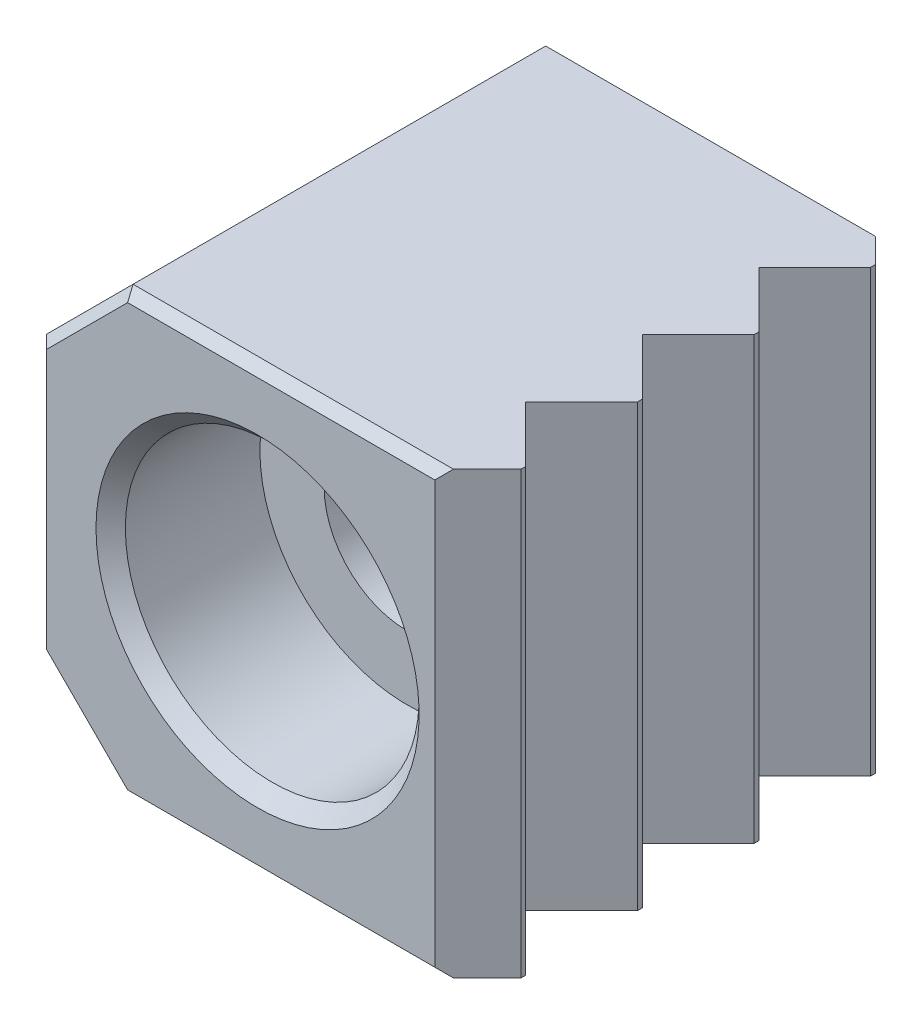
ISO-10303-21;
HEADER;
FILE_DESCRIPTION(('STEP AP214'),'2;1');
FILE_NAME('part.step','',(''),(''),'','','');
FILE_SCHEMA(('AUTOMOTIVE_DESIGN { 1 0 10303 214 1 1 1 1 }'));
ENDSEC;
DATA;
#1=APPLICATION_CONTEXT('core data for automotive mechanical design processes');
#2=APPLICATION_PROTOCOL_DEFINITION('international standard','automotive_design',2000,#1);
#3=PRODUCT_CONTEXT('',#1,'mechanical');
#4=PRODUCT('Part','Part','',(#3));
#5=PRODUCT_RELATED_PRODUCT_CATEGORY('part','',(#4));
#6=PRODUCT_DEFINITION_FORMATION('','',#4);
#7=PRODUCT_DEFINITION_CONTEXT('part definition',#1,'design');
#8=PRODUCT_DEFINITION('design','',#6,#7);
#9=PRODUCT_DEFINITION_SHAPE('','',#8);
#10=(LENGTH_UNIT() NAMED_UNIT(*) SI_UNIT(.MILLI.,.METRE.));
#11=(NAMED_UNIT(*) PLANE_ANGLE_UNIT() SI_UNIT($,.RADIAN.));
#12=(NAMED_UNIT(*) SI_UNIT($,.STERADIAN.) SOLID_ANGLE_UNIT());
#13=UNCERTAINTY_MEASURE_WITH_UNIT(LENGTH_MEASURE(1.E-05),#10,'distance_accuracy_value','');
#14=(GEOMETRIC_REPRESENTATION_CONTEXT(3) GLOBAL_UNCERTAINTY_ASSIGNED_CONTEXT((#13)) GLOBAL_UNIT_ASSIGNED_CONTEXT((#10,
#11,#12)) REPRESENTATION_CONTEXT('',''));
#15=CARTESIAN_POINT('',(0.,0.,0.));
#16=DIRECTION('',(0.,0.,1.));
#17=DIRECTION('',(1.,0.,0.));
#18=AXIS2_PLACEMENT_3D('',#15,#16,#17);
#19=CARTESIAN_POINT('',(6.,-6.,12.));
#20=DIRECTION('',(-1.,0.,0.));
#21=DIRECTION('',(0.,0.,-1.));
#22=AXIS2_PLACEMENT_3D('',#19,#20,#21);
#23=PLANE('',#22);
#24=DIRECTION('',(0.,0.,-1.));
#25=VECTOR('',#24,1.);
#26=CARTESIAN_POINT('',(6.,-6.,12.));
#27=LINE('',#26,#25);
#28=CARTESIAN_POINT('',(6.,-6.,7.652500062));
#29=VERTEX_POINT('',#28);
#30=CARTESIAN_POINT('',(6.,-6.,7.522500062));
#31=VERTEX_POINT('',#30);
#32=EDGE_CURVE('E387',#29,#31,#27,.T.);
#33=ORIENTED_EDGE('',*,*,#32,.T.);
#34=DIRECTION('',(0.,1.,0.));
#35=VECTOR('',#34,1.);
#36=CARTESIAN_POINT('',(6.,-6.,7.522500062));
#37=LINE('',#36,#35);
#38=CARTESIAN_POINT('',(6.,6.,7.522500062));
#39=VERTEX_POINT('',#38);
#40=EDGE_CURVE('E250',#31,#39,#37,.T.);
#41=ORIENTED_EDGE('',*,*,#40,.T.);
#42=DIRECTION('',(0.,0.,-1.));
#43=VECTOR('',#42,1.);
#44=CARTESIAN_POINT('',(6.,6.,12.));
#45=LINE('',#44,#43);
#46=CARTESIAN_POINT('',(6.,6.,7.652500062));
#47=VERTEX_POINT('',#46);
#48=EDGE_CURVE('E406',#47,#39,#45,.T.);
#49=ORIENTED_EDGE('',*,*,#48,.F.);
#50=DIRECTION('',(0.,1.,0.));
#51=VECTOR('',#50,1.);
#52=CARTESIAN_POINT('',(6.,-6.,7.652500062));
#53=LINE('',#52,#51);
#54=EDGE_CURVE('E248',#29,#47,#53,.T.);
#55=ORIENTED_EDGE('',*,*,#54,.F.);
#56=EDGE_LOOP('',(#33,#41,#49,#55));
#57=FACE_BOUND('',#56,.T.);
#58=ADVANCED_FACE('F15',(#57),#23,.F.);
#59=DIRECTION('',(0.,-1.,0.));
#60=VECTOR('',#59,1.);
#61=CARTESIAN_POINT('',(6.,-6.,10.697500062));
#62=LINE('',#61,#60);
#63=CARTESIAN_POINT('',(6.,6.,10.697500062));
#64=VERTEX_POINT('',#63);
#65=CARTESIAN_POINT('',(6.,-6.,10.697500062));
#66=VERTEX_POINT('',#65);
#67=EDGE_CURVE('E246',#64,#66,#62,.T.);
#68=ORIENTED_EDGE('',*,*,#67,.F.);
#69=CARTESIAN_POINT('',(6.,6.,10.827500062));
#70=VERTEX_POINT('',#69);
#71=EDGE_CURVE('E266',#70,#64,#45,.T.);
#72=ORIENTED_EDGE('',*,*,#71,.F.);
#73=DIRECTION('',(0.,1.,0.));
#74=VECTOR('',#73,1.);
#75=CARTESIAN_POINT('',(6.,-6.,10.827500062));
#76=LINE('',#75,#74);
#77=CARTESIAN_POINT('',(6.,-6.,10.827500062));
#78=VERTEX_POINT('',#77);
#79=EDGE_CURVE('E238',#78,#70,#76,.T.);
#80=ORIENTED_EDGE('',*,*,#79,.F.);
#81=EDGE_CURVE('E261',#78,#66,#27,.T.);
#82=ORIENTED_EDGE('',*,*,#81,.T.);
#83=EDGE_LOOP('',(#68,#72,#80,#82));
#84=FACE_BOUND('',#83,.T.);
#85=ADVANCED_FACE('F353',(#84),#23,.F.);
#86=CARTESIAN_POINT('',(6.,-6.,1.302500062));
#87=VERTEX_POINT('',#86);
#88=CARTESIAN_POINT('',(6.,-6.,1.172500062));
#89=VERTEX_POINT('',#88);
#90=EDGE_CURVE('E199',#87,#89,#27,.T.);
#91=ORIENTED_EDGE('',*,*,#90,.T.);
#92=DIRECTION('',(0.,1.,0.));
#93=VECTOR('',#92,1.);
#94=CARTESIAN_POINT('',(6.,-6.,1.172500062));
#95=LINE('',#94,#93);
#96=CARTESIAN_POINT('',(6.,6.,1.172500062));
#97=VERTEX_POINT('',#96);
#98=EDGE_CURVE('E233',#89,#97,#95,.T.);
#99=ORIENTED_EDGE('',*,*,#98,.T.);
#100=CARTESIAN_POINT('',(6.,6.,1.302500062));
#101=VERTEX_POINT('',#100);
#102=EDGE_CURVE('E262',#101,#97,#45,.T.);
#103=ORIENTED_EDGE('',*,*,#102,.F.);
#104=DIRECTION('',(0.,-1.,0.));
#105=VECTOR('',#104,1.);
#106=CARTESIAN_POINT('',(6.,-6.,1.30250006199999));
#107=LINE('',#106,#105);
#108=EDGE_CURVE('E244',#101,#87,#107,.T.);
#109=ORIENTED_EDGE('',*,*,#108,.T.);
#110=EDGE_LOOP('',(#91,#99,#103,#109));
#111=FACE_BOUND('',#110,.T.);
#112=ADVANCED_FACE('F360',(#111),#23,.F.);
#113=CARTESIAN_POINT('',(-6.,6.,12.));
#114=DIRECTION('',(0.,1.,0.));
#115=DIRECTION('',(-1.,0.,0.));
#116=AXIS2_PLACEMENT_3D('',#113,#114,#115);
#117=PLANE('',#116);
#118=DIRECTION('',(0.,0.,1.));
#119=VECTOR('',#118,1.);
#120=CARTESIAN_POINT('',(-3.64415,6.,12.));
#121=LINE('',#120,#119);
#122=CARTESIAN_POINT('',(-3.64415,6.,0.508));
#123=VERTEX_POINT('',#122);
#124=CARTESIAN_POINT('',(-3.64415,6.,11.746));
#125=VERTEX_POINT('',#124);
#126=EDGE_CURVE('E279',#123,#125,#121,.T.);
#127=ORIENTED_EDGE('',*,*,#126,.T.);
#128=DIRECTION('',(1.,0.,0.));
#129=VECTOR('',#128,1.);
#130=CARTESIAN_POINT('',(4.827500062,6.,11.746));
#131=LINE('',#130,#129);
#132=CARTESIAN_POINT('',(5.081500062,6.,11.746));
#133=VERTEX_POINT('',#132);
#134=EDGE_CURVE('E329',#125,#133,#131,.T.);
#135=ORIENTED_EDGE('',*,*,#134,.T.);
#136=DIRECTION('',(-0.707106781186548,0.,0.707106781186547));
#137=VECTOR('',#136,1.);
#138=CARTESIAN_POINT('',(6.065,6.,10.762500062));
#139=LINE('',#138,#137);
#140=EDGE_CURVE('E226',#70,#133,#139,.T.);
#141=ORIENTED_EDGE('',*,*,#140,.F.);
#142=ORIENTED_EDGE('',*,*,#71,.T.);
#143=DIRECTION('',(0.707106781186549,0.,0.707106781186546));
#144=VECTOR('',#143,1.);
#145=CARTESIAN_POINT('',(4.4775,6.,9.17500006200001));
#146=LINE('',#145,#144);
#147=CARTESIAN_POINT('',(4.4775,6.,9.17500006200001));
#148=VERTEX_POINT('',#147);
#149=EDGE_CURVE('E229',#148,#64,#146,.T.);
#150=ORIENTED_EDGE('',*,*,#149,.F.);
#151=DIRECTION('',(-0.707106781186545,0.,0.70710678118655));
#152=VECTOR('',#151,1.);
#153=CARTESIAN_POINT('',(6.065,6.,7.587500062));
#154=LINE('',#153,#152);
#155=EDGE_CURVE('E231',#47,#148,#154,.T.);
#156=ORIENTED_EDGE('',*,*,#155,.F.);
#157=ORIENTED_EDGE('',*,*,#48,.T.);
#158=DIRECTION('',(-0.707106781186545,0.,-0.70710678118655));
#159=VECTOR('',#158,1.);
#160=CARTESIAN_POINT('',(6.065,6.,7.587500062));
#161=LINE('',#160,#159);
#162=CARTESIAN_POINT('',(4.4775,6.,6.00000006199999));
#163=VERTEX_POINT('',#162);
#164=EDGE_CURVE('E214',#39,#163,#161,.T.);
#165=ORIENTED_EDGE('',*,*,#164,.T.);
#166=DIRECTION('',(0.70710678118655,0.,-0.707106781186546));
#167=VECTOR('',#166,1.);
#168=CARTESIAN_POINT('',(4.4775,6.,6.00000006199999));
#169=LINE('',#168,#167);
#170=CARTESIAN_POINT('',(6.,6.,4.477500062));
#171=VERTEX_POINT('',#170);
#172=EDGE_CURVE('E217',#163,#171,#169,.T.);
#173=ORIENTED_EDGE('',*,*,#172,.T.);
#174=CARTESIAN_POINT('',(6.,6.,4.347500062));
#175=VERTEX_POINT('',#174);
#176=EDGE_CURVE('E265',#171,#175,#45,.T.);
#177=ORIENTED_EDGE('',*,*,#176,.T.);
#178=DIRECTION('',(-0.707106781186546,0.,-0.70710678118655));
#179=VECTOR('',#178,1.);
#180=CARTESIAN_POINT('',(6.065,6.,4.412500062));
#181=LINE('',#180,#179);
#182=CARTESIAN_POINT('',(4.4775,6.,2.82500006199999));
#183=VERTEX_POINT('',#182);
#184=EDGE_CURVE('E220',#175,#183,#181,.T.);
#185=ORIENTED_EDGE('',*,*,#184,.T.);
#186=DIRECTION('',(0.70710678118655,0.,-0.707106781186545));
#187=VECTOR('',#186,1.);
#188=CARTESIAN_POINT('',(4.4775,6.,2.82500006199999));
#189=LINE('',#188,#187);
#190=EDGE_CURVE('E189',#183,#101,#189,.T.);
#191=ORIENTED_EDGE('',*,*,#190,.T.);
#192=ORIENTED_EDGE('',*,*,#102,.T.);
#193=DIRECTION('',(-0.707106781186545,0.,-0.70710678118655));
#194=VECTOR('',#193,1.);
#195=CARTESIAN_POINT('',(6.065,6.,1.237500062));
#196=LINE('',#195,#194);
#197=CARTESIAN_POINT('',(5.33549993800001,6.,0.508));
#198=VERTEX_POINT('',#197);
#199=EDGE_CURVE('E223',#97,#198,#196,.T.);
#200=ORIENTED_EDGE('',*,*,#199,.T.);
#201=DIRECTION('',(-1.,0.,0.));
#202=VECTOR('',#201,1.);
#203=CARTESIAN_POINT('',(-6.,6.,0.508));
#204=LINE('',#203,#202);
#205=EDGE_CURVE('E306',#198,#123,#204,.T.);
#206=ORIENTED_EDGE('',*,*,#205,.T.);
#207=EDGE_LOOP('',(#127,#135,#141,#142,#150,#156,#157,#165,#173,#177,#185,#191,#192,#200,#206));
#208=FACE_BOUND('',#207,.T.);
#209=ADVANCED_FACE('F377',(#208),#117,.T.);
#210=CARTESIAN_POINT('',(6.,-6.,12.));
#211=DIRECTION('',(0.,-1.,0.));
#212=DIRECTION('',(1.,0.,0.));
#213=AXIS2_PLACEMENT_3D('',#210,#211,#212);
#214=PLANE('',#213);
#215=DIRECTION('',(-0.707106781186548,0.,0.707106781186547));
#216=VECTOR('',#215,1.);
#217=CARTESIAN_POINT('',(6.065,-6.,10.762500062));
#218=LINE('',#217,#216);
#219=CARTESIAN_POINT('',(5.08150006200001,-6.,11.746));
#220=VERTEX_POINT('',#219);
#221=EDGE_CURVE('E203',#78,#220,#218,.T.);
#222=ORIENTED_EDGE('',*,*,#221,.T.);
#223=DIRECTION('',(-1.,0.,0.));
#224=VECTOR('',#223,1.);
#225=CARTESIAN_POINT('',(-3.64415,-6.,11.746));
#226=LINE('',#225,#224);
#227=CARTESIAN_POINT('',(-3.64415,-6.,11.746));
#228=VERTEX_POINT('',#227);
#229=EDGE_CURVE('E308',#220,#228,#226,.T.);
#230=ORIENTED_EDGE('',*,*,#229,.T.);
#231=DIRECTION('',(0.,0.,-1.));
#232=VECTOR('',#231,1.);
#233=CARTESIAN_POINT('',(-3.64415,-6.,0.));
#234=LINE('',#233,#232);
#235=CARTESIAN_POINT('',(-3.64415,-6.,0.508));
#236=VERTEX_POINT('',#235);
#237=EDGE_CURVE('E273',#228,#236,#234,.T.);
#238=ORIENTED_EDGE('',*,*,#237,.T.);
#239=DIRECTION('',(1.,0.,0.));
#240=VECTOR('',#239,1.);
#241=CARTESIAN_POINT('',(6.,-6.,0.508));
#242=LINE('',#241,#240);
#243=CARTESIAN_POINT('',(5.33549993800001,-6.,0.508));
#244=VERTEX_POINT('',#243);
#245=EDGE_CURVE('E292',#236,#244,#242,.T.);
#246=ORIENTED_EDGE('',*,*,#245,.T.);
#247=DIRECTION('',(-0.707106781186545,0.,-0.70710678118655));
#248=VECTOR('',#247,1.);
#249=CARTESIAN_POINT('',(6.065,-6.,1.237500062));
#250=LINE('',#249,#248);
#251=EDGE_CURVE('E200',#89,#244,#250,.T.);
#252=ORIENTED_EDGE('',*,*,#251,.F.);
#253=ORIENTED_EDGE('',*,*,#90,.F.);
#254=DIRECTION('',(0.70710678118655,0.,-0.707106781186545));
#255=VECTOR('',#254,1.);
#256=CARTESIAN_POINT('',(4.4775,-6.,2.82500006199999));
#257=LINE('',#256,#255);
#258=CARTESIAN_POINT('',(4.4775,-6.,2.82500006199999));
#259=VERTEX_POINT('',#258);
#260=EDGE_CURVE('E182',#259,#87,#257,.T.);
#261=ORIENTED_EDGE('',*,*,#260,.F.);
#262=DIRECTION('',(-0.707106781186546,0.,-0.70710678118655));
#263=VECTOR('',#262,1.);
#264=CARTESIAN_POINT('',(6.065,-6.,4.412500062));
#265=LINE('',#264,#263);
#266=CARTESIAN_POINT('',(6.,-6.,4.347500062));
#267=VERTEX_POINT('',#266);
#268=EDGE_CURVE('E171',#267,#259,#265,.T.);
#269=ORIENTED_EDGE('',*,*,#268,.F.);
#270=CARTESIAN_POINT('',(6.,-6.,4.477500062));
#271=VERTEX_POINT('',#270);
#272=EDGE_CURVE('E260',#271,#267,#27,.T.);
#273=ORIENTED_EDGE('',*,*,#272,.F.);
#274=DIRECTION('',(0.70710678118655,0.,-0.707106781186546));
#275=VECTOR('',#274,1.);
#276=CARTESIAN_POINT('',(4.4775,-6.,6.00000006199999));
#277=LINE('',#276,#275);
#278=CARTESIAN_POINT('',(4.4775,-6.,6.00000006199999));
#279=VERTEX_POINT('',#278);
#280=EDGE_CURVE('E183',#279,#271,#277,.T.);
#281=ORIENTED_EDGE('',*,*,#280,.F.);
#282=DIRECTION('',(-0.707106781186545,0.,-0.70710678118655));
#283=VECTOR('',#282,1.);
#284=CARTESIAN_POINT('',(6.065,-6.,7.587500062));
#285=LINE('',#284,#283);
#286=EDGE_CURVE('E411',#31,#279,#285,.T.);
#287=ORIENTED_EDGE('',*,*,#286,.F.);
#288=ORIENTED_EDGE('',*,*,#32,.F.);
#289=DIRECTION('',(-0.707106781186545,0.,0.70710678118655));
#290=VECTOR('',#289,1.);
#291=CARTESIAN_POINT('',(6.065,-6.,7.587500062));
#292=LINE('',#291,#290);
#293=CARTESIAN_POINT('',(4.4775,-6.,9.17500006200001));
#294=VERTEX_POINT('',#293);
#295=EDGE_CURVE('E211',#29,#294,#292,.T.);
#296=ORIENTED_EDGE('',*,*,#295,.T.);
#297=DIRECTION('',(0.707106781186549,0.,0.707106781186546));
#298=VECTOR('',#297,1.);
#299=CARTESIAN_POINT('',(4.4775,-6.,9.17500006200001));
#300=LINE('',#299,#298);
#301=EDGE_CURVE('E208',#294,#66,#300,.T.);
#302=ORIENTED_EDGE('',*,*,#301,.T.);
#303=ORIENTED_EDGE('',*,*,#81,.F.);
#304=EDGE_LOOP('',(#222,#230,#238,#246,#252,#253,#261,#269,#273,#281,#287,#288,#296,#302,#303));
#305=FACE_BOUND('',#304,.T.);
#306=ADVANCED_FACE('F196',(#305),#214,.T.);
#307=CARTESIAN_POINT('',(6.,6.,12.));
#308=DIRECTION('',(0.,0.,-1.));
#309=DIRECTION('',(1.,0.,0.));
#310=AXIS2_PLACEMENT_3D('',#307,#308,#309);
#311=PLANE('',#310);
#312=CARTESIAN_POINT('',(0.,0.,12.));
#313=DIRECTION('',(0.,0.,-1.));
#314=DIRECTION('',(-1.,0.,0.));
#315=AXIS2_PLACEMENT_3D('',#312,#313,#314);
#316=CIRCLE('',#315,4.4);
#317=CARTESIAN_POINT('',(-4.4,0.,12.));
#318=VERTEX_POINT('',#317);
#319=EDGE_CURVE('E9',#318,#318,#316,.T.);
#320=ORIENTED_EDGE('',*,*,#319,.T.);
#321=EDGE_LOOP('',(#320));
#322=FACE_BOUND('',#321,.T.);
#323=DIRECTION('',(0.707106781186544,-0.707106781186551,0.));
#324=VECTOR('',#323,1.);
#325=CARTESIAN_POINT('',(-3.4645448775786,-5.82039487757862,12.));
#326=LINE('',#325,#324);
#327=CARTESIAN_POINT('',(-5.746,-3.5389397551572,12.));
#328=VERTEX_POINT('',#327);
#329=CARTESIAN_POINT('',(-3.53893975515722,-5.746,12.));
#330=VERTEX_POINT('',#329);
#331=EDGE_CURVE('E317',#328,#330,#326,.T.);
#332=ORIENTED_EDGE('',*,*,#331,.T.);
#333=DIRECTION('',(1.,0.,0.));
#334=VECTOR('',#333,1.);
#335=CARTESIAN_POINT('',(4.827500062,-5.746,12.));
#336=LINE('',#335,#334);
#337=CARTESIAN_POINT('',(4.827500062,-5.746,12.));
#338=VERTEX_POINT('',#337);
#339=EDGE_CURVE('E319',#330,#338,#336,.T.);
#340=ORIENTED_EDGE('',*,*,#339,.T.);
#341=DIRECTION('',(0.,-1.,0.));
#342=VECTOR('',#341,1.);
#343=CARTESIAN_POINT('',(4.827500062,6.,12.));
#344=LINE('',#343,#342);
#345=CARTESIAN_POINT('',(4.827500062,5.746,12.));
#346=VERTEX_POINT('',#345);
#347=EDGE_CURVE('E270',#346,#338,#344,.T.);
#348=ORIENTED_EDGE('',*,*,#347,.F.);
#349=DIRECTION('',(-1.,0.,0.));
#350=VECTOR('',#349,1.);
#351=CARTESIAN_POINT('',(-3.64415,5.746,12.));
#352=LINE('',#351,#350);
#353=CARTESIAN_POINT('',(-3.53893975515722,5.746,12.));
#354=VERTEX_POINT('',#353);
#355=EDGE_CURVE('E311',#346,#354,#352,.T.);
#356=ORIENTED_EDGE('',*,*,#355,.T.);
#357=DIRECTION('',(-0.707106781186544,-0.707106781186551,0.));
#358=VECTOR('',#357,1.);
#359=CARTESIAN_POINT('',(-5.82039487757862,3.46454487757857,12.));
#360=LINE('',#359,#358);
#361=CARTESIAN_POINT('',(-5.746,3.5389397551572,12.));
#362=VERTEX_POINT('',#361);
#363=EDGE_CURVE('E313',#354,#362,#360,.T.);
#364=ORIENTED_EDGE('',*,*,#363,.T.);
#365=DIRECTION('',(0.,-1.,0.));
#366=VECTOR('',#365,1.);
#367=CARTESIAN_POINT('',(-5.746,6.,12.));
#368=LINE('',#367,#366);
#369=EDGE_CURVE('E315',#362,#328,#368,.T.);
#370=ORIENTED_EDGE('',*,*,#369,.T.);
#371=EDGE_LOOP('',(#332,#340,#348,#356,#364,#370));
#372=FACE_BOUND('',#371,.T.);
#373=ADVANCED_FACE('F366',(#322,#372),#311,.F.);
#374=ORIENTED_EDGE('',*,*,#272,.T.);
#375=DIRECTION('',(0.,1.,0.));
#376=VECTOR('',#375,1.);
#377=CARTESIAN_POINT('',(6.,-6.,4.347500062));
#378=LINE('',#377,#376);
#379=EDGE_CURVE('E177',#267,#175,#378,.T.);
#380=ORIENTED_EDGE('',*,*,#379,.T.);
#381=ORIENTED_EDGE('',*,*,#176,.F.);
#382=DIRECTION('',(0.,-1.,0.));
#383=VECTOR('',#382,1.);
#384=CARTESIAN_POINT('',(6.,-6.,4.477500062));
#385=LINE('',#384,#383);
#386=EDGE_CURVE('E240',#171,#271,#385,.T.);
#387=ORIENTED_EDGE('',*,*,#386,.T.);
#388=EDGE_LOOP('',(#374,#380,#381,#387));
#389=FACE_BOUND('',#388,.T.);
#390=ADVANCED_FACE('F356',(#389),#23,.F.);
#391=CARTESIAN_POINT('',(-6.,6.,12.));
#392=DIRECTION('',(1.,0.,0.));
#393=DIRECTION('',(0.,0.,1.));
#394=AXIS2_PLACEMENT_3D('',#391,#392,#393);
#395=PLANE('',#394);
#396=DIRECTION('',(0.,0.,1.));
#397=VECTOR('',#396,1.);
#398=CARTESIAN_POINT('',(-6.,-3.64415,12.));
#399=LINE('',#398,#397);
#400=CARTESIAN_POINT('',(-6.,-3.64415,0.508));
#401=VERTEX_POINT('',#400);
#402=CARTESIAN_POINT('',(-6.,-3.64415,11.746));
#403=VERTEX_POINT('',#402);
#404=EDGE_CURVE('E277',#401,#403,#399,.T.);
#405=ORIENTED_EDGE('',*,*,#404,.T.);
#406=DIRECTION('',(0.,1.,0.));
#407=VECTOR('',#406,1.);
#408=CARTESIAN_POINT('',(-6.,6.,11.746));
#409=LINE('',#408,#407);
#410=CARTESIAN_POINT('',(-6.,3.64415,11.746));
#411=VERTEX_POINT('',#410);
#412=EDGE_CURVE('E38',#403,#411,#409,.T.);
#413=ORIENTED_EDGE('',*,*,#412,.T.);
#414=DIRECTION('',(0.,0.,-1.));
#415=VECTOR('',#414,1.);
#416=CARTESIAN_POINT('',(-6.,3.64415,0.));
#417=LINE('',#416,#415);
#418=CARTESIAN_POINT('',(-6.,3.64415,0.508));
#419=VERTEX_POINT('',#418);
#420=EDGE_CURVE('E275',#411,#419,#417,.T.);
#421=ORIENTED_EDGE('',*,*,#420,.T.);
#422=DIRECTION('',(0.,-1.,0.));
#423=VECTOR('',#422,1.);
#424=CARTESIAN_POINT('',(-6.,-3.64415,0.508));
#425=LINE('',#424,#423);
#426=EDGE_CURVE('E301',#419,#401,#425,.T.);
#427=ORIENTED_EDGE('',*,*,#426,.T.);
#428=EDGE_LOOP('',(#405,#413,#421,#427));
#429=FACE_BOUND('',#428,.T.);
#430=ADVANCED_FACE('F365',(#429),#395,.F.);
#431=CARTESIAN_POINT('',(6.,6.,0.));
#432=DIRECTION('',(0.,0.,-1.));
#433=DIRECTION('',(1.,0.,0.));
#434=AXIS2_PLACEMENT_3D('',#431,#432,#433);
#435=PLANE('',#434);
#436=CARTESIAN_POINT('',(0.,0.,0.));
#437=DIRECTION('',(0.,0.,-1.));
#438=DIRECTION('',(-1.,0.,0.));
#439=AXIS2_PLACEMENT_3D('',#436,#437,#438);
#440=CIRCLE('',#439,2.65);
#441=CARTESIAN_POINT('',(-2.65,0.,0.));
#442=VERTEX_POINT('',#441);
#443=EDGE_CURVE('E331',#442,#442,#440,.F.);
#444=ORIENTED_EDGE('',*,*,#443,.T.);
#445=EDGE_LOOP('',(#444));
#446=FACE_BOUND('',#445,.T.);
#447=DIRECTION('',(0.,1.,0.));
#448=VECTOR('',#447,1.);
#449=CARTESIAN_POINT('',(4.82749993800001,6.,0.));
#450=LINE('',#449,#448);
#451=CARTESIAN_POINT('',(4.82749993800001,-5.492,0.));
#452=VERTEX_POINT('',#451);
#453=CARTESIAN_POINT('',(4.82749993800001,5.492,0.));
#454=VERTEX_POINT('',#453);
#455=EDGE_CURVE('E267',#452,#454,#450,.T.);
#456=ORIENTED_EDGE('',*,*,#455,.F.);
#457=DIRECTION('',(-1.,0.,0.));
#458=VECTOR('',#457,1.);
#459=CARTESIAN_POINT('',(6.,-5.492,0.));
#460=LINE('',#459,#458);
#461=CARTESIAN_POINT('',(-3.43372951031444,-5.492,0.));
#462=VERTEX_POINT('',#461);
#463=EDGE_CURVE('E289',#452,#462,#460,.T.);
#464=ORIENTED_EDGE('',*,*,#463,.T.);
#465=DIRECTION('',(-0.707106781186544,0.707106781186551,0.));
#466=VECTOR('',#465,1.);
#467=CARTESIAN_POINT('',(-4.46286475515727,-4.46286475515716,0.));
#468=LINE('',#467,#466);
#469=CARTESIAN_POINT('',(-5.492,-3.43372951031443,0.));
#470=VERTEX_POINT('',#469);
#471=EDGE_CURVE('E287',#462,#470,#468,.T.);
#472=ORIENTED_EDGE('',*,*,#471,.T.);
#473=DIRECTION('',(0.,1.,0.));
#474=VECTOR('',#473,1.);
#475=CARTESIAN_POINT('',(-5.492,3.64415,0.));
#476=LINE('',#475,#474);
#477=CARTESIAN_POINT('',(-5.492,3.43372951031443,0.));
#478=VERTEX_POINT('',#477);
#479=EDGE_CURVE('E285',#470,#478,#476,.T.);
#480=ORIENTED_EDGE('',*,*,#479,.T.);
#481=DIRECTION('',(0.707106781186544,0.707106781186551,0.));
#482=VECTOR('',#481,1.);
#483=CARTESIAN_POINT('',(1.53713524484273,10.4628647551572,0.));
#484=LINE('',#483,#482);
#485=CARTESIAN_POINT('',(-3.43372951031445,5.492,0.));
#486=VERTEX_POINT('',#485);
#487=EDGE_CURVE('E283',#478,#486,#484,.T.);
#488=ORIENTED_EDGE('',*,*,#487,.T.);
#489=DIRECTION('',(1.,0.,0.));
#490=VECTOR('',#489,1.);
#491=CARTESIAN_POINT('',(6.,5.492,0.));
#492=LINE('',#491,#490);
#493=EDGE_CURVE('E281',#486,#454,#492,.T.);
#494=ORIENTED_EDGE('',*,*,#493,.T.);
#495=EDGE_LOOP('',(#456,#464,#472,#480,#488,#494));
#496=FACE_BOUND('',#495,.T.);
#497=ADVANCED_FACE('F372',(#446,#496),#435,.T.);
#498=CARTESIAN_POINT('',(0.,0.,7.936));
#499=DIRECTION('',(0.,0.,1.));
#500=DIRECTION('',(-1.,0.,0.));
#501=AXIS2_PLACEMENT_3D('',#498,#499,#500);
#502=CYLINDRICAL_SURFACE('',#501,4.);
#503=CARTESIAN_POINT('',(0.,0.,11.6));
#504=DIRECTION('',(0.,0.,-1.));
#505=DIRECTION('',(-1.,0.,0.));
#506=AXIS2_PLACEMENT_3D('',#503,#504,#505);
#507=CIRCLE('',#506,4.);
#508=CARTESIAN_POINT('',(-4.,0.,11.6));
#509=VERTEX_POINT('',#508);
#510=EDGE_CURVE('E23',#509,#509,#507,.F.);
#511=ORIENTED_EDGE('',*,*,#510,.T.);
#512=EDGE_LOOP('',(#511));
#513=FACE_BOUND('',#512,.T.);
#514=CARTESIAN_POINT('',(0.,0.,7.936));
#515=DIRECTION('',(0.,0.,1.));
#516=DIRECTION('',(-1.,0.,0.));
#517=AXIS2_PLACEMENT_3D('',#514,#515,#516);
#518=CIRCLE('',#517,4.);
#519=CARTESIAN_POINT('',(-4.,0.,7.936));
#520=VERTEX_POINT('',#519);
#521=EDGE_CURVE('E256',#520,#520,#518,.T.);
#522=ORIENTED_EDGE('',*,*,#521,.F.);
#523=EDGE_LOOP('',(#522));
#524=FACE_BOUND('',#523,.T.);
#525=ADVANCED_FACE('F339',(#513,#524),#502,.F.);
#526=CARTESIAN_POINT('',(0.,0.,7.936));
#527=DIRECTION('',(0.,0.,1.));
#528=DIRECTION('',(-1.,0.,0.));
#529=AXIS2_PLACEMENT_3D('',#526,#527,#528);
#530=PLANE('',#529);
#531=CARTESIAN_POINT('',(0.,0.,7.936));
#532=DIRECTION('',(0.,0.,1.));
#533=DIRECTION('',(-1.,0.,0.));
#534=AXIS2_PLACEMENT_3D('',#531,#532,#533);
#535=CIRCLE('',#534,2.25);
#536=CARTESIAN_POINT('',(-2.25,0.,7.936));
#537=VERTEX_POINT('',#536);
#538=EDGE_CURVE('E253',#537,#537,#535,.T.);
#539=ORIENTED_EDGE('',*,*,#538,.F.);
#540=EDGE_LOOP('',(#539));
#541=FACE_BOUND('',#540,.T.);
#542=ORIENTED_EDGE('',*,*,#521,.T.);
#543=EDGE_LOOP('',(#542));
#544=FACE_BOUND('',#543,.T.);
#545=ADVANCED_FACE('F519',(#541,#544),#530,.T.);
#546=CARTESIAN_POINT('',(0.,0.,0.));
#547=DIRECTION('',(0.,0.,1.));
#548=DIRECTION('',(-1.,0.,0.));
#549=AXIS2_PLACEMENT_3D('',#546,#547,#548);
#550=CYLINDRICAL_SURFACE('',#549,2.25);
#551=CARTESIAN_POINT('',(0.,0.,0.4));
#552=DIRECTION('',(0.,0.,-1.));
#553=DIRECTION('',(-1.,0.,0.));
#554=AXIS2_PLACEMENT_3D('',#551,#552,#553);
#555=CIRCLE('',#554,2.25);
#556=CARTESIAN_POINT('',(-2.25,0.,0.4));
#557=VERTEX_POINT('',#556);
#558=EDGE_CURVE('E334',#557,#557,#555,.T.);
#559=ORIENTED_EDGE('',*,*,#558,.T.);
#560=EDGE_LOOP('',(#559));
#561=FACE_BOUND('',#560,.T.);
#562=ORIENTED_EDGE('',*,*,#538,.T.);
#563=EDGE_LOOP('',(#562));
#564=FACE_BOUND('',#563,.T.);
#565=ADVANCED_FACE('F505',(#561,#564),#550,.F.);
#566=CARTESIAN_POINT('',(6.065,6.,1.237500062));
#567=DIRECTION('',(-0.70710678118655,0.,0.707106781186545));
#568=DIRECTION('',(-0.707106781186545,0.,-0.70710678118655));
#569=AXIS2_PLACEMENT_3D('',#566,#567,#568);
#570=PLANE('',#569);
#571=ORIENTED_EDGE('',*,*,#251,.T.);
#572=DIRECTION('',(0.577350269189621,-0.577350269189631,0.577350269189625));
#573=VECTOR('',#572,1.);
#574=CARTESIAN_POINT('',(5.218333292,-5.88283335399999,0.390833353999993));
#575=LINE('',#574,#573);
#576=EDGE_CURVE('E296',#244,#452,#575,.F.);
#577=ORIENTED_EDGE('',*,*,#576,.T.);
#578=ORIENTED_EDGE('',*,*,#455,.T.);
#579=DIRECTION('',(-0.577350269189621,-0.577350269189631,-0.577350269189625));
#580=VECTOR('',#579,1.);
#581=CARTESIAN_POINT('',(5.218333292,5.88283335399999,0.390833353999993));
#582=LINE('',#581,#580);
#583=EDGE_CURVE('E294',#454,#198,#582,.F.);
#584=ORIENTED_EDGE('',*,*,#583,.T.);
#585=ORIENTED_EDGE('',*,*,#199,.F.);
#586=ORIENTED_EDGE('',*,*,#98,.F.);
#587=EDGE_LOOP('',(#571,#577,#578,#584,#585,#586));
#588=FACE_BOUND('',#587,.T.);
#589=ADVANCED_FACE('F465',(#588),#570,.F.);
#590=CARTESIAN_POINT('',(6.065,6.,10.762500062));
#591=DIRECTION('',(0.707106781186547,0.,0.707106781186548));
#592=DIRECTION('',(-0.707106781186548,0.,0.707106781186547));
#593=AXIS2_PLACEMENT_3D('',#590,#591,#592);
#594=PLANE('',#593);
#595=ORIENTED_EDGE('',*,*,#347,.T.);
#596=DIRECTION('',(0.577350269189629,-0.57735026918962,-0.577350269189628));
#597=VECTOR('',#596,1.);
#598=CARTESIAN_POINT('',(1.73716668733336,-2.6556666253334,15.0903333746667));
#599=LINE('',#598,#597);
#600=EDGE_CURVE('E323',#338,#220,#599,.T.);
#601=ORIENTED_EDGE('',*,*,#600,.T.);
#602=ORIENTED_EDGE('',*,*,#221,.F.);
#603=ORIENTED_EDGE('',*,*,#79,.T.);
#604=ORIENTED_EDGE('',*,*,#140,.T.);
#605=DIRECTION('',(-0.577350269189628,-0.577350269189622,0.577350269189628));
#606=VECTOR('',#605,1.);
#607=CARTESIAN_POINT('',(5.73716668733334,6.65566662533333,11.0903333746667));
#608=LINE('',#607,#606);
#609=EDGE_CURVE('E321',#133,#346,#608,.T.);
#610=ORIENTED_EDGE('',*,*,#609,.T.);
#611=EDGE_LOOP('',(#595,#601,#602,#603,#604,#610));
#612=FACE_BOUND('',#611,.T.);
#613=ADVANCED_FACE('F493',(#612),#594,.T.);
#614=CARTESIAN_POINT('',(4.4775,6.,6.00000006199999));
#615=DIRECTION('',(-0.707106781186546,0.,-0.707106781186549));
#616=DIRECTION('',(0.70710678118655,0.,-0.707106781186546));
#617=AXIS2_PLACEMENT_3D('',#614,#615,#616);
#618=PLANE('',#617);
#619=ORIENTED_EDGE('',*,*,#172,.F.);
#620=DIRECTION('',(0.,-1.,0.));
#621=VECTOR('',#620,1.);
#622=CARTESIAN_POINT('',(4.4775,6.,6.00000006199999));
#623=LINE('',#622,#621);
#624=EDGE_CURVE('E192',#163,#279,#623,.T.);
#625=ORIENTED_EDGE('',*,*,#624,.T.);
#626=ORIENTED_EDGE('',*,*,#280,.T.);
#627=ORIENTED_EDGE('',*,*,#386,.F.);
#628=EDGE_LOOP('',(#619,#625,#626,#627));
#629=FACE_BOUND('',#628,.T.);
#630=ADVANCED_FACE('F497',(#629),#618,.F.);
#631=CARTESIAN_POINT('',(6.065,6.,7.587500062));
#632=DIRECTION('',(-0.70710678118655,0.,0.707106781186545));
#633=DIRECTION('',(-0.707106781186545,0.,-0.70710678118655));
#634=AXIS2_PLACEMENT_3D('',#631,#632,#633);
#635=PLANE('',#634);
#636=ORIENTED_EDGE('',*,*,#286,.T.);
#637=ORIENTED_EDGE('',*,*,#624,.F.);
#638=ORIENTED_EDGE('',*,*,#164,.F.);
#639=ORIENTED_EDGE('',*,*,#40,.F.);
#640=EDGE_LOOP('',(#636,#637,#638,#639));
#641=FACE_BOUND('',#640,.T.);
#642=ADVANCED_FACE('F410',(#641),#635,.F.);
#643=CARTESIAN_POINT('',(6.065,6.,4.412500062));
#644=DIRECTION('',(-0.70710678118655,0.,0.707106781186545));
#645=DIRECTION('',(-0.707106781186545,0.,-0.70710678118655));
#646=AXIS2_PLACEMENT_3D('',#643,#644,#645);
#647=PLANE('',#646);
#648=ORIENTED_EDGE('',*,*,#268,.T.);
#649=DIRECTION('',(0.,-1.,0.));
#650=VECTOR('',#649,1.);
#651=CARTESIAN_POINT('',(4.4775,6.,2.82500006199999));
#652=LINE('',#651,#650);
#653=EDGE_CURVE('E174',#183,#259,#652,.T.);
#654=ORIENTED_EDGE('',*,*,#653,.F.);
#655=ORIENTED_EDGE('',*,*,#184,.F.);
#656=ORIENTED_EDGE('',*,*,#379,.F.);
#657=EDGE_LOOP('',(#648,#654,#655,#656));
#658=FACE_BOUND('',#657,.T.);
#659=ADVANCED_FACE('F173',(#658),#647,.F.);
#660=CARTESIAN_POINT('',(4.4775,6.,2.82500006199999));
#661=DIRECTION('',(-0.707106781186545,0.,-0.70710678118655));
#662=DIRECTION('',(0.70710678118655,0.,-0.707106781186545));
#663=AXIS2_PLACEMENT_3D('',#660,#661,#662);
#664=PLANE('',#663);
#665=ORIENTED_EDGE('',*,*,#190,.F.);
#666=ORIENTED_EDGE('',*,*,#653,.T.);
#667=ORIENTED_EDGE('',*,*,#260,.T.);
#668=ORIENTED_EDGE('',*,*,#108,.F.);
#669=EDGE_LOOP('',(#665,#666,#667,#668));
#670=FACE_BOUND('',#669,.T.);
#671=ADVANCED_FACE('F186',(#670),#664,.F.);
#672=CARTESIAN_POINT('',(6.065,6.,7.587500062));
#673=DIRECTION('',(0.70710678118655,0.,0.707106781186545));
#674=DIRECTION('',(-0.707106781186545,0.,0.70710678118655));
#675=AXIS2_PLACEMENT_3D('',#672,#673,#674);
#676=PLANE('',#675);
#677=ORIENTED_EDGE('',*,*,#54,.T.);
#678=ORIENTED_EDGE('',*,*,#155,.T.);
#679=DIRECTION('',(0.,-1.,0.));
#680=VECTOR('',#679,1.);
#681=CARTESIAN_POINT('',(4.4775,6.,9.17500006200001));
#682=LINE('',#681,#680);
#683=EDGE_CURVE('E191',#148,#294,#682,.T.);
#684=ORIENTED_EDGE('',*,*,#683,.T.);
#685=ORIENTED_EDGE('',*,*,#295,.F.);
#686=EDGE_LOOP('',(#677,#678,#684,#685));
#687=FACE_BOUND('',#686,.T.);
#688=ADVANCED_FACE('F512',(#687),#676,.T.);
#689=CARTESIAN_POINT('',(4.4775,6.,9.17500006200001));
#690=DIRECTION('',(0.707106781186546,0.,-0.707106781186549));
#691=DIRECTION('',(0.707106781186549,0.,0.707106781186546));
#692=AXIS2_PLACEMENT_3D('',#689,#690,#691);
#693=PLANE('',#692);
#694=ORIENTED_EDGE('',*,*,#67,.T.);
#695=ORIENTED_EDGE('',*,*,#301,.F.);
#696=ORIENTED_EDGE('',*,*,#683,.F.);
#697=ORIENTED_EDGE('',*,*,#149,.T.);
#698=EDGE_LOOP('',(#694,#695,#696,#697));
#699=FACE_BOUND('',#698,.T.);
#700=ADVANCED_FACE('F400',(#699),#693,.T.);
#701=CARTESIAN_POINT('',(-3.64415,-6.,12.));
#702=DIRECTION('',(-0.707106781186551,-0.707106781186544,0.));
#703=DIRECTION('',(0.707106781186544,-0.707106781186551,0.));
#704=AXIS2_PLACEMENT_3D('',#701,#702,#703);
#705=PLANE('',#704);
#706=ORIENTED_EDGE('',*,*,#237,.F.);
#707=DIRECTION('',(-0.707106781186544,0.707106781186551,0.));
#708=VECTOR('',#707,1.);
#709=CARTESIAN_POINT('',(-6.,-3.64415,11.746));
#710=LINE('',#709,#708);
#711=EDGE_CURVE('E325',#228,#403,#710,.T.);
#712=ORIENTED_EDGE('',*,*,#711,.T.);
#713=ORIENTED_EDGE('',*,*,#404,.F.);
#714=DIRECTION('',(0.707106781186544,-0.707106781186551,0.));
#715=VECTOR('',#714,1.);
#716=CARTESIAN_POINT('',(-3.64415,-6.,0.508));
#717=LINE('',#716,#715);
#718=EDGE_CURVE('E298',#401,#236,#717,.T.);
#719=ORIENTED_EDGE('',*,*,#718,.T.);
#720=EDGE_LOOP('',(#706,#712,#713,#719));
#721=FACE_BOUND('',#720,.T.);
#722=ADVANCED_FACE('F447',(#721),#705,.T.);
#723=CARTESIAN_POINT('',(-6.,3.64415,12.));
#724=DIRECTION('',(-0.707106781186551,0.707106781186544,0.));
#725=DIRECTION('',(-0.707106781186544,-0.707106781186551,0.));
#726=AXIS2_PLACEMENT_3D('',#723,#724,#725);
#727=PLANE('',#726);
#728=ORIENTED_EDGE('',*,*,#420,.F.);
#729=DIRECTION('',(0.707106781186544,0.707106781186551,0.));
#730=VECTOR('',#729,1.);
#731=CARTESIAN_POINT('',(-3.64415,6.,11.746));
#732=LINE('',#731,#730);
#733=EDGE_CURVE('E30',#411,#125,#732,.T.);
#734=ORIENTED_EDGE('',*,*,#733,.T.);
#735=ORIENTED_EDGE('',*,*,#126,.F.);
#736=DIRECTION('',(-0.707106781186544,-0.707106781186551,0.));
#737=VECTOR('',#736,1.);
#738=CARTESIAN_POINT('',(-6.,3.64415,0.508));
#739=LINE('',#738,#737);
#740=EDGE_CURVE('E303',#123,#419,#739,.T.);
#741=ORIENTED_EDGE('',*,*,#740,.T.);
#742=EDGE_LOOP('',(#728,#734,#735,#741));
#743=FACE_BOUND('',#742,.T.);
#744=ADVANCED_FACE('F472',(#743),#727,.T.);
#745=CARTESIAN_POINT('',(6.,5.492,0.));
#746=DIRECTION('',(0.,-0.707106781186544,0.707106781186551));
#747=DIRECTION('',(0.,-0.707106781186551,-0.707106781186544));
#748=AXIS2_PLACEMENT_3D('',#745,#746,#747);
#749=PLANE('',#748);
#750=ORIENTED_EDGE('',*,*,#583,.F.);
#751=ORIENTED_EDGE('',*,*,#493,.F.);
#752=DIRECTION('',(-0.281084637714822,0.67859834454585,0.678598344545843));
#753=VECTOR('',#752,1.);
#754=CARTESIAN_POINT('',(-2.68838399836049,3.69257675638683,-1.79942324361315));
#755=LINE('',#754,#753);
#756=EDGE_CURVE('E412',#123,#486,#755,.F.);
#757=ORIENTED_EDGE('',*,*,#756,.F.);
#758=ORIENTED_EDGE('',*,*,#205,.F.);
#759=EDGE_LOOP('',(#750,#751,#757,#758));
#760=FACE_BOUND('',#759,.T.);
#761=ADVANCED_FACE('F468',(#760),#749,.F.);
#762=CARTESIAN_POINT('',(1.53713524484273,10.4628647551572,0.));
#763=DIRECTION('',(0.5,-0.5,0.707106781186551));
#764=DIRECTION('',(-0.816496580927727,0.,0.577350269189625));
#765=AXIS2_PLACEMENT_3D('',#762,#763,#764);
#766=PLANE('',#765);
#767=ORIENTED_EDGE('',*,*,#756,.T.);
#768=ORIENTED_EDGE('',*,*,#487,.F.);
#769=DIRECTION('',(0.678598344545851,-0.281084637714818,-0.678598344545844));
#770=VECTOR('',#769,1.);
#771=CARTESIAN_POINT('',(-3.59587570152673,2.64832910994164,-1.89612429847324));
#772=LINE('',#771,#770);
#773=EDGE_CURVE('E415',#419,#478,#772,.T.);
#774=ORIENTED_EDGE('',*,*,#773,.F.);
#775=ORIENTED_EDGE('',*,*,#740,.F.);
#776=EDGE_LOOP('',(#767,#768,#774,#775));
#777=FACE_BOUND('',#776,.T.);
#778=ADVANCED_FACE('F477',(#777),#766,.F.);
#779=CARTESIAN_POINT('',(-6.,6.,0.508));
#780=DIRECTION('',(-0.707106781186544,0.,-0.707106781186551));
#781=DIRECTION('',(0.707106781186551,0.,-0.707106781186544));
#782=AXIS2_PLACEMENT_3D('',#779,#780,#781);
#783=PLANE('',#782);
#784=ORIENTED_EDGE('',*,*,#773,.T.);
#785=ORIENTED_EDGE('',*,*,#479,.F.);
#786=DIRECTION('',(0.678598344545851,0.28108463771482,-0.678598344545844));
#787=VECTOR('',#786,1.);
#788=CARTESIAN_POINT('',(-4.16044040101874,-2.88217946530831,-1.33155959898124));
#789=LINE('',#788,#787);
#790=EDGE_CURVE('E420',#401,#470,#789,.T.);
#791=ORIENTED_EDGE('',*,*,#790,.F.);
#792=ORIENTED_EDGE('',*,*,#426,.F.);
#793=EDGE_LOOP('',(#784,#785,#791,#792));
#794=FACE_BOUND('',#793,.T.);
#795=ADVANCED_FACE('F479',(#794),#783,.T.);
#796=CARTESIAN_POINT('',(-4.46286475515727,-4.46286475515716,0.));
#797=DIRECTION('',(0.5,0.5,0.707106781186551));
#798=DIRECTION('',(-0.816496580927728,0.,0.577350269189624));
#799=AXIS2_PLACEMENT_3D('',#796,#797,#798);
#800=PLANE('',#799);
#801=ORIENTED_EDGE('',*,*,#790,.T.);
#802=ORIENTED_EDGE('',*,*,#471,.F.);
#803=DIRECTION('',(-0.281084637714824,-0.67859834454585,0.678598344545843));
#804=VECTOR('',#803,1.);
#805=CARTESIAN_POINT('',(-3.31873908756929,-5.21438856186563,-0.277611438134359));
#806=LINE('',#805,#804);
#807=EDGE_CURVE('E423',#236,#462,#806,.F.);
#808=ORIENTED_EDGE('',*,*,#807,.F.);
#809=ORIENTED_EDGE('',*,*,#718,.F.);
#810=EDGE_LOOP('',(#801,#802,#808,#809));
#811=FACE_BOUND('',#810,.T.);
#812=ADVANCED_FACE('F458',(#811),#800,.F.);
#813=CARTESIAN_POINT('',(6.,-5.492,0.));
#814=DIRECTION('',(0.,0.707106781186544,0.707106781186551));
#815=DIRECTION('',(0.,-0.707106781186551,0.707106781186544));
#816=AXIS2_PLACEMENT_3D('',#813,#814,#815);
#817=PLANE('',#816);
#818=ORIENTED_EDGE('',*,*,#576,.F.);
#819=ORIENTED_EDGE('',*,*,#245,.F.);
#820=ORIENTED_EDGE('',*,*,#807,.T.);
#821=ORIENTED_EDGE('',*,*,#463,.F.);
#822=EDGE_LOOP('',(#818,#819,#820,#821));
#823=FACE_BOUND('',#822,.T.);
#824=ADVANCED_FACE('F455',(#823),#817,.F.);
#825=CARTESIAN_POINT('',(-6.,6.,11.746));
#826=DIRECTION('',(0.,0.707106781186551,0.707106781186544));
#827=DIRECTION('',(0.,-0.707106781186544,0.707106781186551));
#828=AXIS2_PLACEMENT_3D('',#825,#826,#827);
#829=PLANE('',#828);
#830=ORIENTED_EDGE('',*,*,#609,.F.);
#831=ORIENTED_EDGE('',*,*,#134,.F.);
#832=DIRECTION('',(0.281084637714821,-0.678598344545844,0.67859834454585));
#833=VECTOR('',#832,1.);
#834=CARTESIAN_POINT('',(-3.83028234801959,6.44936323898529,11.2966367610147));
#835=LINE('',#834,#833);
#836=EDGE_CURVE('E425',#354,#125,#835,.F.);
#837=ORIENTED_EDGE('',*,*,#836,.F.);
#838=ORIENTED_EDGE('',*,*,#355,.F.);
#839=EDGE_LOOP('',(#830,#831,#837,#838));
#840=FACE_BOUND('',#839,.T.);
#841=ADVANCED_FACE('F491',(#840),#829,.T.);
#842=CARTESIAN_POINT('',(1.35753012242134,10.6424698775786,12.));
#843=DIRECTION('',(-0.5,0.5,0.707106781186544));
#844=DIRECTION('',(-0.816496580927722,0.,-0.577350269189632));
#845=AXIS2_PLACEMENT_3D('',#842,#843,#844);
#846=PLANE('',#845);
#847=ORIENTED_EDGE('',*,*,#836,.T.);
#848=ORIENTED_EDGE('',*,*,#733,.F.);
#849=DIRECTION('',(-0.678598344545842,0.28108463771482,-0.678598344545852));
#850=VECTOR('',#849,1.);
#851=CARTESIAN_POINT('',(-3.82980752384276,2.74522684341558,13.9161924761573));
#852=LINE('',#851,#850);
#853=EDGE_CURVE('E428',#362,#411,#852,.T.);
#854=ORIENTED_EDGE('',*,*,#853,.F.);
#855=ORIENTED_EDGE('',*,*,#363,.F.);
#856=EDGE_LOOP('',(#847,#848,#854,#855));
#857=FACE_BOUND('',#856,.T.);
#858=ADVANCED_FACE('F486',(#857),#846,.T.);
#859=CARTESIAN_POINT('',(-5.746,6.,12.));
#860=DIRECTION('',(0.707106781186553,0.,-0.707106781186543));
#861=DIRECTION('',(0.707106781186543,0.,0.707106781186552));
#862=AXIS2_PLACEMENT_3D('',#859,#860,#861);
#863=PLANE('',#862);
#864=ORIENTED_EDGE('',*,*,#853,.T.);
#865=ORIENTED_EDGE('',*,*,#412,.F.);
#866=DIRECTION('',(-0.678598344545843,-0.281084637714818,-0.678598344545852));
#867=VECTOR('',#866,1.);
#868=CARTESIAN_POINT('',(-3.92650857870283,-2.7852817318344,13.8194914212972));
#869=LINE('',#868,#867);
#870=EDGE_CURVE('E431',#328,#403,#869,.T.);
#871=ORIENTED_EDGE('',*,*,#870,.F.);
#872=ORIENTED_EDGE('',*,*,#369,.F.);
#873=EDGE_LOOP('',(#864,#865,#871,#872));
#874=FACE_BOUND('',#873,.T.);
#875=ADVANCED_FACE('F481',(#874),#863,.F.);
#876=CARTESIAN_POINT('',(-4.64246987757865,-4.64246987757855,12.));
#877=DIRECTION('',(-0.500000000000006,-0.5,0.707106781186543));
#878=DIRECTION('',(-0.816496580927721,0.,-0.577350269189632));
#879=AXIS2_PLACEMENT_3D('',#876,#877,#878);
#880=PLANE('',#879);
#881=ORIENTED_EDGE('',*,*,#870,.T.);
#882=ORIENTED_EDGE('',*,*,#711,.F.);
#883=DIRECTION('',(0.281084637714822,0.678598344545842,0.678598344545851));
#884=VECTOR('',#883,1.);
#885=CARTESIAN_POINT('',(-3.41563682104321,-5.44832038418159,12.2976796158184));
#886=LINE('',#885,#884);
#887=EDGE_CURVE('E434',#330,#228,#886,.F.);
#888=ORIENTED_EDGE('',*,*,#887,.F.);
#889=ORIENTED_EDGE('',*,*,#331,.F.);
#890=EDGE_LOOP('',(#881,#882,#888,#889));
#891=FACE_BOUND('',#890,.T.);
#892=ADVANCED_FACE('F442',(#891),#880,.T.);
#893=CARTESIAN_POINT('',(6.,-6.,11.746));
#894=DIRECTION('',(0.,-0.707106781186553,0.707106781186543));
#895=DIRECTION('',(0.,-0.707106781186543,-0.707106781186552));
#896=AXIS2_PLACEMENT_3D('',#893,#894,#895);
#897=PLANE('',#896);
#898=ORIENTED_EDGE('',*,*,#600,.F.);
#899=ORIENTED_EDGE('',*,*,#339,.F.);
#900=ORIENTED_EDGE('',*,*,#887,.T.);
#901=ORIENTED_EDGE('',*,*,#229,.F.);
#902=EDGE_LOOP('',(#898,#899,#900,#901));
#903=FACE_BOUND('',#902,.T.);
#904=ADVANCED_FACE('F349',(#903),#897,.T.);
#905=CARTESIAN_POINT('',(0.,0.,0.));
#906=DIRECTION('',(0.,0.,-1.));
#907=DIRECTION('',(-1.,0.,0.));
#908=AXIS2_PLACEMENT_3D('',#905,#906,#907);
#909=CONICAL_SURFACE('',#908,2.65,0.785398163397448);
#910=ORIENTED_EDGE('',*,*,#558,.F.);
#911=EDGE_LOOP('',(#910));
#912=FACE_BOUND('',#911,.T.);
#913=ORIENTED_EDGE('',*,*,#443,.F.);
#914=EDGE_LOOP('',(#913));
#915=FACE_BOUND('',#914,.T.);
#916=ADVANCED_FACE('F343',(#912,#915),#909,.F.);
#917=CARTESIAN_POINT('',(0.,0.,11.6));
#918=DIRECTION('',(0.,0.,1.));
#919=DIRECTION('',(1.,0.,0.));
#920=AXIS2_PLACEMENT_3D('',#917,#918,#919);
#921=CONICAL_SURFACE('',#920,4.,0.785398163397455);
#922=ORIENTED_EDGE('',*,*,#319,.F.);
#923=EDGE_LOOP('',(#922));
#924=FACE_BOUND('',#923,.T.);
#925=ORIENTED_EDGE('',*,*,#510,.F.);
#926=EDGE_LOOP('',(#925));
#927=FACE_BOUND('',#926,.T.);
#928=ADVANCED_FACE('F17',(#924,#927),#921,.F.);
#929=CLOSED_SHELL('',(#58,#85,#112,#209,#306,#373,#390,#430,#497,#525,#545,#565,#589,#613,#630,
#642,#659,#671,#688,#700,#722,#744,#761,#778,#795,#812,#824,#841,#858,#875,#892,#904,#916,#928));
#930=MANIFOLD_SOLID_BREP('B1',#929);
#931=ADVANCED_BREP_SHAPE_REPRESENTATION('',(#18,#930),#14);
#932=SHAPE_DEFINITION_REPRESENTATION(#9,#931);
ENDSEC;
END-ISO-10303-21;
